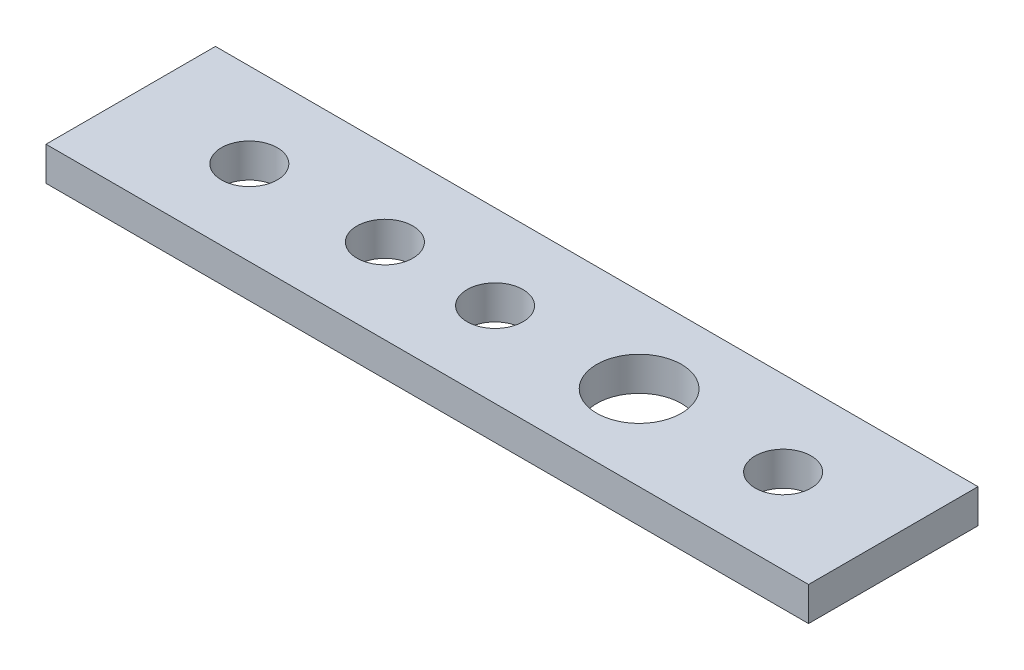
ISO-10303-21;
HEADER;
FILE_DESCRIPTION(('STEP AP214'),'2;1');
FILE_NAME('part.step','',(''),(''),'','','');
FILE_SCHEMA(('AUTOMOTIVE_DESIGN { 1 0 10303 214 1 1 1 1 }'));
ENDSEC;
DATA;
#1=APPLICATION_CONTEXT('core data for automotive mechanical design processes');
#2=APPLICATION_PROTOCOL_DEFINITION('international standard','automotive_design',2000,#1);
#3=PRODUCT_CONTEXT('',#1,'mechanical');
#4=PRODUCT('Part','Part','',(#3));
#5=PRODUCT_RELATED_PRODUCT_CATEGORY('part','',(#4));
#6=PRODUCT_DEFINITION_FORMATION('','',#4);
#7=PRODUCT_DEFINITION_CONTEXT('part definition',#1,'design');
#8=PRODUCT_DEFINITION('design','',#6,#7);
#9=PRODUCT_DEFINITION_SHAPE('','',#8);
#10=(LENGTH_UNIT() NAMED_UNIT(*) SI_UNIT(.MILLI.,.METRE.));
#11=(NAMED_UNIT(*) PLANE_ANGLE_UNIT() SI_UNIT($,.RADIAN.));
#12=(NAMED_UNIT(*) SI_UNIT($,.STERADIAN.) SOLID_ANGLE_UNIT());
#13=UNCERTAINTY_MEASURE_WITH_UNIT(LENGTH_MEASURE(1.E-05),#10,'distance_accuracy_value','');
#14=(GEOMETRIC_REPRESENTATION_CONTEXT(3) GLOBAL_UNCERTAINTY_ASSIGNED_CONTEXT((#13)) GLOBAL_UNIT_ASSIGNED_CONTEXT((#10,
#11,#12)) REPRESENTATION_CONTEXT('',''));
#15=CARTESIAN_POINT('',(0.,0.,0.));
#16=DIRECTION('',(0.,0.,1.));
#17=DIRECTION('',(1.,0.,0.));
#18=AXIS2_PLACEMENT_3D('',#15,#16,#17);
#19=CARTESIAN_POINT('',(0.,2.,0.));
#20=DIRECTION('',(1.,0.,0.));
#21=DIRECTION('',(0.,0.,-1.));
#22=AXIS2_PLACEMENT_3D('',#19,#20,#21);
#23=PLANE('',#22);
#24=DIRECTION('',(0.,0.,1.));
#25=VECTOR('',#24,1.);
#26=CARTESIAN_POINT('',(0.,0.,0.));
#27=LINE('',#26,#25);
#28=CARTESIAN_POINT('',(0.,0.,-10.));
#29=VERTEX_POINT('',#28);
#30=CARTESIAN_POINT('',(0.,0.,0.));
#31=VERTEX_POINT('',#30);
#32=EDGE_CURVE('E107',#29,#31,#27,.T.);
#33=ORIENTED_EDGE('',*,*,#32,.T.);
#34=DIRECTION('',(0.,-1.,0.));
#35=VECTOR('',#34,1.);
#36=CARTESIAN_POINT('',(0.,2.,0.));
#37=LINE('',#36,#35);
#38=CARTESIAN_POINT('',(0.,2.,0.));
#39=VERTEX_POINT('',#38);
#40=EDGE_CURVE('E13',#39,#31,#37,.T.);
#41=ORIENTED_EDGE('',*,*,#40,.F.);
#42=DIRECTION('',(0.,0.,1.));
#43=VECTOR('',#42,1.);
#44=CARTESIAN_POINT('',(0.,2.,0.));
#45=LINE('',#44,#43);
#46=CARTESIAN_POINT('',(0.,2.,-10.));
#47=VERTEX_POINT('',#46);
#48=EDGE_CURVE('E95',#47,#39,#45,.T.);
#49=ORIENTED_EDGE('',*,*,#48,.F.);
#50=DIRECTION('',(0.,-1.,0.));
#51=VECTOR('',#50,1.);
#52=CARTESIAN_POINT('',(0.,2.,-10.));
#53=LINE('',#52,#51);
#54=EDGE_CURVE('E103',#47,#29,#53,.T.);
#55=ORIENTED_EDGE('',*,*,#54,.T.);
#56=EDGE_LOOP('',(#33,#41,#49,#55));
#57=FACE_BOUND('',#56,.T.);
#58=ADVANCED_FACE('F44',(#57),#23,.F.);
#59=CARTESIAN_POINT('',(0.,2.,0.));
#60=DIRECTION('',(0.,0.,-1.));
#61=DIRECTION('',(-1.,0.,0.));
#62=AXIS2_PLACEMENT_3D('',#59,#60,#61);
#63=PLANE('',#62);
#64=DIRECTION('',(1.,0.,0.));
#65=VECTOR('',#64,1.);
#66=CARTESIAN_POINT('',(0.,0.,0.));
#67=LINE('',#66,#65);
#68=CARTESIAN_POINT('',(45.,0.,0.));
#69=VERTEX_POINT('',#68);
#70=EDGE_CURVE('E99',#31,#69,#67,.T.);
#71=ORIENTED_EDGE('',*,*,#70,.T.);
#72=DIRECTION('',(0.,-1.,0.));
#73=VECTOR('',#72,1.);
#74=CARTESIAN_POINT('',(45.,2.,0.));
#75=LINE('',#74,#73);
#76=CARTESIAN_POINT('',(45.,2.,0.));
#77=VERTEX_POINT('',#76);
#78=EDGE_CURVE('E52',#77,#69,#75,.T.);
#79=ORIENTED_EDGE('',*,*,#78,.F.);
#80=DIRECTION('',(1.,0.,0.));
#81=VECTOR('',#80,1.);
#82=CARTESIAN_POINT('',(0.,2.,0.));
#83=LINE('',#82,#81);
#84=EDGE_CURVE('E90',#39,#77,#83,.T.);
#85=ORIENTED_EDGE('',*,*,#84,.F.);
#86=ORIENTED_EDGE('',*,*,#40,.T.);
#87=EDGE_LOOP('',(#71,#79,#85,#86));
#88=FACE_BOUND('',#87,.T.);
#89=ADVANCED_FACE('F98',(#88),#63,.F.);
#90=CARTESIAN_POINT('',(45.,2.,0.));
#91=DIRECTION('',(-1.,0.,0.));
#92=DIRECTION('',(0.,0.,1.));
#93=AXIS2_PLACEMENT_3D('',#90,#91,#92);
#94=PLANE('',#93);
#95=DIRECTION('',(0.,0.,-1.));
#96=VECTOR('',#95,1.);
#97=CARTESIAN_POINT('',(45.,0.,0.));
#98=LINE('',#97,#96);
#99=CARTESIAN_POINT('',(45.,0.,-10.));
#100=VERTEX_POINT('',#99);
#101=EDGE_CURVE('E77',#69,#100,#98,.T.);
#102=ORIENTED_EDGE('',*,*,#101,.T.);
#103=DIRECTION('',(0.,-1.,0.));
#104=VECTOR('',#103,1.);
#105=CARTESIAN_POINT('',(45.,2.,-10.));
#106=LINE('',#105,#104);
#107=CARTESIAN_POINT('',(45.,2.,-10.));
#108=VERTEX_POINT('',#107);
#109=EDGE_CURVE('E100',#108,#100,#106,.T.);
#110=ORIENTED_EDGE('',*,*,#109,.F.);
#111=DIRECTION('',(0.,0.,-1.));
#112=VECTOR('',#111,1.);
#113=CARTESIAN_POINT('',(45.,2.,0.));
#114=LINE('',#113,#112);
#115=EDGE_CURVE('E93',#77,#108,#114,.T.);
#116=ORIENTED_EDGE('',*,*,#115,.F.);
#117=ORIENTED_EDGE('',*,*,#78,.T.);
#118=EDGE_LOOP('',(#102,#110,#116,#117));
#119=FACE_BOUND('',#118,.T.);
#120=ADVANCED_FACE('F101',(#119),#94,.F.);
#121=CARTESIAN_POINT('',(0.,2.,-10.));
#122=DIRECTION('',(0.,0.,1.));
#123=DIRECTION('',(1.,0.,0.));
#124=AXIS2_PLACEMENT_3D('',#121,#122,#123);
#125=PLANE('',#124);
#126=DIRECTION('',(-1.,0.,0.));
#127=VECTOR('',#126,1.);
#128=CARTESIAN_POINT('',(0.,0.,-10.));
#129=LINE('',#128,#127);
#130=EDGE_CURVE('E83',#100,#29,#129,.T.);
#131=ORIENTED_EDGE('',*,*,#130,.T.);
#132=ORIENTED_EDGE('',*,*,#54,.F.);
#133=DIRECTION('',(-1.,0.,0.));
#134=VECTOR('',#133,1.);
#135=CARTESIAN_POINT('',(0.,2.,-10.));
#136=LINE('',#135,#134);
#137=EDGE_CURVE('E60',#108,#47,#136,.T.);
#138=ORIENTED_EDGE('',*,*,#137,.F.);
#139=ORIENTED_EDGE('',*,*,#109,.T.);
#140=EDGE_LOOP('',(#131,#132,#138,#139));
#141=FACE_BOUND('',#140,.T.);
#142=ADVANCED_FACE('F115',(#141),#125,.F.);
#143=CARTESIAN_POINT('',(0.,2.,0.));
#144=DIRECTION('',(0.,-1.,0.));
#145=DIRECTION('',(0.,0.,-1.));
#146=AXIS2_PLACEMENT_3D('',#143,#144,#145);
#147=PLANE('',#146);
#148=CARTESIAN_POINT('',(30.,2.,-4.99999999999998));
#149=DIRECTION('',(0.,-1.,0.));
#150=DIRECTION('',(0.,0.,-1.));
#151=AXIS2_PLACEMENT_3D('',#148,#149,#150);
#152=CIRCLE('',#151,2.5);
#153=CARTESIAN_POINT('',(30.,2.,-7.49999999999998));
#154=VERTEX_POINT('',#153);
#155=EDGE_CURVE('E144',#154,#154,#152,.T.);
#156=ORIENTED_EDGE('',*,*,#155,.T.);
#157=EDGE_LOOP('',(#156));
#158=FACE_BOUND('',#157,.T.);
#159=CARTESIAN_POINT('',(21.5,2.,-4.99999999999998));
#160=DIRECTION('',(0.,1.,0.));
#161=DIRECTION('',(0.,0.,1.));
#162=AXIS2_PLACEMENT_3D('',#159,#160,#161);
#163=CIRCLE('',#162,1.64999999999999);
#164=CARTESIAN_POINT('',(21.5,2.,-3.34999999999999));
#165=VERTEX_POINT('',#164);
#166=EDGE_CURVE('E141',#165,#165,#163,.T.);
#167=ORIENTED_EDGE('',*,*,#166,.F.);
#168=EDGE_LOOP('',(#167));
#169=FACE_BOUND('',#168,.T.);
#170=CARTESIAN_POINT('',(38.5,2.,-4.99999999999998));
#171=DIRECTION('',(0.,1.,0.));
#172=DIRECTION('',(0.,0.,1.));
#173=AXIS2_PLACEMENT_3D('',#170,#171,#172);
#174=CIRCLE('',#173,1.64999999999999);
#175=CARTESIAN_POINT('',(38.5,2.,-3.34999999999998));
#176=VERTEX_POINT('',#175);
#177=EDGE_CURVE('E135',#176,#176,#174,.T.);
#178=ORIENTED_EDGE('',*,*,#177,.F.);
#179=EDGE_LOOP('',(#178));
#180=FACE_BOUND('',#179,.T.);
#181=CARTESIAN_POINT('',(15.,2.,-4.99999999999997));
#182=DIRECTION('',(0.,1.,0.));
#183=DIRECTION('',(0.,0.,1.));
#184=AXIS2_PLACEMENT_3D('',#181,#182,#183);
#185=CIRCLE('',#184,1.64999999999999);
#186=CARTESIAN_POINT('',(15.,2.,-3.34999999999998));
#187=VERTEX_POINT('',#186);
#188=EDGE_CURVE('E129',#187,#187,#185,.T.);
#189=ORIENTED_EDGE('',*,*,#188,.F.);
#190=EDGE_LOOP('',(#189));
#191=FACE_BOUND('',#190,.T.);
#192=CARTESIAN_POINT('',(7.,2.,-4.99999999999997));
#193=DIRECTION('',(0.,1.,0.));
#194=DIRECTION('',(0.,0.,1.));
#195=AXIS2_PLACEMENT_3D('',#192,#193,#194);
#196=CIRCLE('',#195,1.64999999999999);
#197=CARTESIAN_POINT('',(7.,2.,-3.34999999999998));
#198=VERTEX_POINT('',#197);
#199=EDGE_CURVE('E123',#198,#198,#196,.T.);
#200=ORIENTED_EDGE('',*,*,#199,.F.);
#201=EDGE_LOOP('',(#200));
#202=FACE_BOUND('',#201,.T.);
#203=ORIENTED_EDGE('',*,*,#48,.T.);
#204=ORIENTED_EDGE('',*,*,#84,.T.);
#205=ORIENTED_EDGE('',*,*,#115,.T.);
#206=ORIENTED_EDGE('',*,*,#137,.T.);
#207=EDGE_LOOP('',(#203,#204,#205,#206));
#208=FACE_BOUND('',#207,.T.);
#209=ADVANCED_FACE('F91',(#158,#169,#180,#191,#202,#208),#147,.F.);
#210=CARTESIAN_POINT('',(0.,0.,0.));
#211=DIRECTION('',(0.,-1.,0.));
#212=DIRECTION('',(0.,0.,-1.));
#213=AXIS2_PLACEMENT_3D('',#210,#211,#212);
#214=PLANE('',#213);
#215=CARTESIAN_POINT('',(30.,0.,-4.99999999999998));
#216=DIRECTION('',(0.,-1.,0.));
#217=DIRECTION('',(0.,0.,-1.));
#218=AXIS2_PLACEMENT_3D('',#215,#216,#217);
#219=CIRCLE('',#218,2.5);
#220=CARTESIAN_POINT('',(30.,0.,-7.49999999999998));
#221=VERTEX_POINT('',#220);
#222=EDGE_CURVE('E147',#221,#221,#219,.T.);
#223=ORIENTED_EDGE('',*,*,#222,.F.);
#224=EDGE_LOOP('',(#223));
#225=FACE_BOUND('',#224,.T.);
#226=CARTESIAN_POINT('',(21.5,0.,-4.99999999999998));
#227=DIRECTION('',(0.,1.,0.));
#228=DIRECTION('',(0.,0.,1.));
#229=AXIS2_PLACEMENT_3D('',#226,#227,#228);
#230=CIRCLE('',#229,1.64999999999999);
#231=CARTESIAN_POINT('',(21.5,0.,-3.34999999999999));
#232=VERTEX_POINT('',#231);
#233=EDGE_CURVE('E138',#232,#232,#230,.T.);
#234=ORIENTED_EDGE('',*,*,#233,.T.);
#235=EDGE_LOOP('',(#234));
#236=FACE_BOUND('',#235,.T.);
#237=CARTESIAN_POINT('',(38.5,0.,-4.99999999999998));
#238=DIRECTION('',(0.,1.,0.));
#239=DIRECTION('',(0.,0.,1.));
#240=AXIS2_PLACEMENT_3D('',#237,#238,#239);
#241=CIRCLE('',#240,1.64999999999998);
#242=CARTESIAN_POINT('',(38.5,0.,-3.34999999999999));
#243=VERTEX_POINT('',#242);
#244=EDGE_CURVE('E132',#243,#243,#241,.T.);
#245=ORIENTED_EDGE('',*,*,#244,.T.);
#246=EDGE_LOOP('',(#245));
#247=FACE_BOUND('',#246,.T.);
#248=CARTESIAN_POINT('',(15.,0.,-4.99999999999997));
#249=DIRECTION('',(0.,1.,0.));
#250=DIRECTION('',(0.,0.,1.));
#251=AXIS2_PLACEMENT_3D('',#248,#249,#250);
#252=CIRCLE('',#251,1.64999999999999);
#253=CARTESIAN_POINT('',(15.,0.,-3.34999999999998));
#254=VERTEX_POINT('',#253);
#255=EDGE_CURVE('E126',#254,#254,#252,.T.);
#256=ORIENTED_EDGE('',*,*,#255,.T.);
#257=EDGE_LOOP('',(#256));
#258=FACE_BOUND('',#257,.T.);
#259=CARTESIAN_POINT('',(7.,0.,-4.99999999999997));
#260=DIRECTION('',(0.,1.,0.));
#261=DIRECTION('',(0.,0.,1.));
#262=AXIS2_PLACEMENT_3D('',#259,#260,#261);
#263=CIRCLE('',#262,1.64999999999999);
#264=CARTESIAN_POINT('',(7.,0.,-3.34999999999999));
#265=VERTEX_POINT('',#264);
#266=EDGE_CURVE('E110',#265,#265,#263,.T.);
#267=ORIENTED_EDGE('',*,*,#266,.T.);
#268=EDGE_LOOP('',(#267));
#269=FACE_BOUND('',#268,.T.);
#270=ORIENTED_EDGE('',*,*,#32,.F.);
#271=ORIENTED_EDGE('',*,*,#130,.F.);
#272=ORIENTED_EDGE('',*,*,#101,.F.);
#273=ORIENTED_EDGE('',*,*,#70,.F.);
#274=EDGE_LOOP('',(#270,#271,#272,#273));
#275=FACE_BOUND('',#274,.T.);
#276=ADVANCED_FACE('F118',(#225,#236,#247,#258,#269,#275),#214,.T.);
#277=CARTESIAN_POINT('',(7.,2.,-4.99999999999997));
#278=DIRECTION('',(0.,1.,0.));
#279=DIRECTION('',(0.,0.,1.));
#280=AXIS2_PLACEMENT_3D('',#277,#278,#279);
#281=CYLINDRICAL_SURFACE('',#280,1.64999999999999);
#282=ORIENTED_EDGE('',*,*,#266,.F.);
#283=EDGE_LOOP('',(#282));
#284=FACE_BOUND('',#283,.T.);
#285=ORIENTED_EDGE('',*,*,#199,.T.);
#286=EDGE_LOOP('',(#285));
#287=FACE_BOUND('',#286,.T.);
#288=ADVANCED_FACE('F155',(#284,#287),#281,.F.);
#289=CARTESIAN_POINT('',(15.,2.,-4.99999999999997));
#290=DIRECTION('',(0.,1.,0.));
#291=DIRECTION('',(0.,0.,1.));
#292=AXIS2_PLACEMENT_3D('',#289,#290,#291);
#293=CYLINDRICAL_SURFACE('',#292,1.64999999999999);
#294=ORIENTED_EDGE('',*,*,#255,.F.);
#295=EDGE_LOOP('',(#294));
#296=FACE_BOUND('',#295,.T.);
#297=ORIENTED_EDGE('',*,*,#188,.T.);
#298=EDGE_LOOP('',(#297));
#299=FACE_BOUND('',#298,.T.);
#300=ADVANCED_FACE('F167',(#296,#299),#293,.F.);
#301=CARTESIAN_POINT('',(38.5,2.,-4.99999999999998));
#302=DIRECTION('',(0.,1.,0.));
#303=DIRECTION('',(0.,0.,1.));
#304=AXIS2_PLACEMENT_3D('',#301,#302,#303);
#305=CYLINDRICAL_SURFACE('',#304,1.64999999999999);
#306=ORIENTED_EDGE('',*,*,#244,.F.);
#307=EDGE_LOOP('',(#306));
#308=FACE_BOUND('',#307,.T.);
#309=ORIENTED_EDGE('',*,*,#177,.T.);
#310=EDGE_LOOP('',(#309));
#311=FACE_BOUND('',#310,.T.);
#312=ADVANCED_FACE('F215',(#308,#311),#305,.F.);
#313=CARTESIAN_POINT('',(21.5,2.,-4.99999999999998));
#314=DIRECTION('',(0.,1.,0.));
#315=DIRECTION('',(0.,0.,1.));
#316=AXIS2_PLACEMENT_3D('',#313,#314,#315);
#317=CYLINDRICAL_SURFACE('',#316,1.64999999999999);
#318=ORIENTED_EDGE('',*,*,#233,.F.);
#319=EDGE_LOOP('',(#318));
#320=FACE_BOUND('',#319,.T.);
#321=ORIENTED_EDGE('',*,*,#166,.T.);
#322=EDGE_LOOP('',(#321));
#323=FACE_BOUND('',#322,.T.);
#324=ADVANCED_FACE('F223',(#320,#323),#317,.F.);
#325=CARTESIAN_POINT('',(30.,0.,-4.99999999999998));
#326=DIRECTION('',(0.,-1.,0.));
#327=DIRECTION('',(0.,0.,-1.));
#328=AXIS2_PLACEMENT_3D('',#325,#326,#327);
#329=CYLINDRICAL_SURFACE('',#328,2.5);
#330=ORIENTED_EDGE('',*,*,#155,.F.);
#331=EDGE_LOOP('',(#330));
#332=FACE_BOUND('',#331,.T.);
#333=ORIENTED_EDGE('',*,*,#222,.T.);
#334=EDGE_LOOP('',(#333));
#335=FACE_BOUND('',#334,.T.);
#336=ADVANCED_FACE('F151',(#332,#335),#329,.F.);
#337=CLOSED_SHELL('',(#58,#89,#120,#142,#209,#276,#288,#300,#312,#324,#336));
#338=MANIFOLD_SOLID_BREP('B2',#337);
#339=ADVANCED_BREP_SHAPE_REPRESENTATION('',(#18,#338),#14);
#340=SHAPE_DEFINITION_REPRESENTATION(#9,#339);
ENDSEC;
END-ISO-10303-21;
